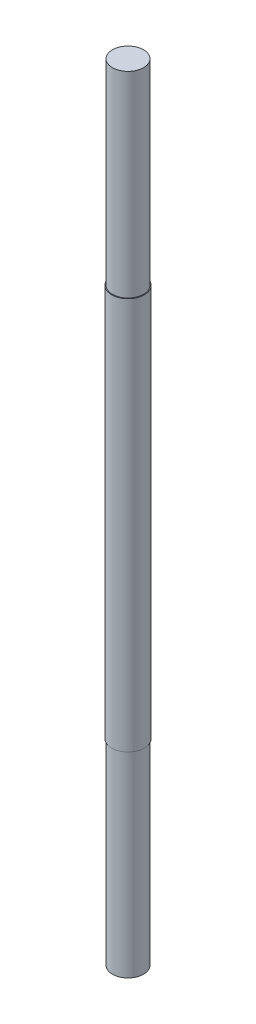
ISO-10303-21;
HEADER;
FILE_DESCRIPTION(('STEP AP214'),'2;1');
FILE_NAME('part.step','',(''),(''),'','','');
FILE_SCHEMA(('AUTOMOTIVE_DESIGN { 1 0 10303 214 1 1 1 1 }'));
ENDSEC;
DATA;
#1=APPLICATION_CONTEXT('core data for automotive mechanical design processes');
#2=APPLICATION_PROTOCOL_DEFINITION('international standard','automotive_design',2000,#1);
#3=PRODUCT_CONTEXT('',#1,'mechanical');
#4=PRODUCT('Part','Part','',(#3));
#5=PRODUCT_RELATED_PRODUCT_CATEGORY('part','',(#4));
#6=PRODUCT_DEFINITION_FORMATION('','',#4);
#7=PRODUCT_DEFINITION_CONTEXT('part definition',#1,'design');
#8=PRODUCT_DEFINITION('design','',#6,#7);
#9=PRODUCT_DEFINITION_SHAPE('','',#8);
#10=(LENGTH_UNIT() NAMED_UNIT(*) SI_UNIT(.MILLI.,.METRE.));
#11=(NAMED_UNIT(*) PLANE_ANGLE_UNIT() SI_UNIT($,.RADIAN.));
#12=(NAMED_UNIT(*) SI_UNIT($,.STERADIAN.) SOLID_ANGLE_UNIT());
#13=UNCERTAINTY_MEASURE_WITH_UNIT(LENGTH_MEASURE(1.E-05),#10,'distance_accuracy_value','');
#14=(GEOMETRIC_REPRESENTATION_CONTEXT(3) GLOBAL_UNCERTAINTY_ASSIGNED_CONTEXT((#13)) GLOBAL_UNIT_ASSIGNED_CONTEXT((#10,
#11,#12)) REPRESENTATION_CONTEXT('',''));
#15=CARTESIAN_POINT('',(0.,0.,0.));
#16=DIRECTION('',(0.,0.,1.));
#17=DIRECTION('',(1.,0.,0.));
#18=AXIS2_PLACEMENT_3D('',#15,#16,#17);
#19=CARTESIAN_POINT('',(0.,152.4,0.));
#20=DIRECTION('',(0.,-1.,0.));
#21=DIRECTION('',(0.,0.,-1.));
#22=AXIS2_PLACEMENT_3D('',#19,#20,#21);
#23=CYLINDRICAL_SURFACE('',#22,6.35);
#24=CARTESIAN_POINT('',(0.,76.2,0.));
#25=DIRECTION('',(0.,1.,0.));
#26=DIRECTION('',(0.,0.,1.));
#27=AXIS2_PLACEMENT_3D('',#24,#25,#26);
#28=CIRCLE('',#27,6.35);
#29=CARTESIAN_POINT('',(0.,76.2,-6.35));
#30=VERTEX_POINT('',#29);
#31=EDGE_CURVE('E10',#30,#30,#28,.T.);
#32=CARTESIAN_POINT('',(0.,-76.2,0.));
#33=DIRECTION('',(0.,-1.,0.));
#34=DIRECTION('',(0.,0.,-1.));
#35=AXIS2_PLACEMENT_3D('',#32,#33,#34);
#36=CIRCLE('',#35,6.35);
#37=CARTESIAN_POINT('',(0.,-76.2,-6.35));
#38=VERTEX_POINT('',#37);
#39=EDGE_CURVE('E36',#38,#38,#36,.T.);
#40=CARTESIAN_POINT('',(0.,76.2,-6.35));
#41=CARTESIAN_POINT('',(0.,74.6125,-6.35));
#42=CARTESIAN_POINT('',(0.,73.025,-6.35));
#43=CARTESIAN_POINT('',(0.,69.85,-6.35));
#44=CARTESIAN_POINT('',(0.,68.2625,-6.35));
#45=CARTESIAN_POINT('',(0.,65.0875,-6.35));
#46=CARTESIAN_POINT('',(0.,63.5,-6.35));
#47=CARTESIAN_POINT('',(0.,60.325,-6.35));
#48=CARTESIAN_POINT('',(0.,58.7375,-6.35));
#49=CARTESIAN_POINT('',(0.,55.5625,-6.35));
#50=CARTESIAN_POINT('',(0.,53.975,-6.35));
#51=CARTESIAN_POINT('',(0.,50.8,-6.35));
#52=CARTESIAN_POINT('',(0.,49.2125,-6.35));
#53=CARTESIAN_POINT('',(0.,46.0375,-6.35));
#54=CARTESIAN_POINT('',(0.,44.45,-6.35));
#55=CARTESIAN_POINT('',(0.,41.275,-6.35));
#56=CARTESIAN_POINT('',(0.,39.6875,-6.35));
#57=CARTESIAN_POINT('',(0.,36.5125,-6.35));
#58=CARTESIAN_POINT('',(0.,34.925,-6.35));
#59=CARTESIAN_POINT('',(0.,31.75,-6.35));
#60=CARTESIAN_POINT('',(0.,30.1625,-6.35));
#61=CARTESIAN_POINT('',(0.,26.9875,-6.35));
#62=CARTESIAN_POINT('',(0.,25.4,-6.35));
#63=CARTESIAN_POINT('',(0.,22.225,-6.35));
#64=CARTESIAN_POINT('',(0.,20.6375,-6.35));
#65=CARTESIAN_POINT('',(0.,17.4625,-6.35));
#66=CARTESIAN_POINT('',(0.,15.875,-6.35));
#67=CARTESIAN_POINT('',(0.,12.7,-6.35));
#68=CARTESIAN_POINT('',(0.,11.1125,-6.35));
#69=CARTESIAN_POINT('',(0.,7.93750000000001,-6.35));
#70=CARTESIAN_POINT('',(0.,6.35,-6.35));
#71=CARTESIAN_POINT('',(0.,3.175,-6.35));
#72=CARTESIAN_POINT('',(0.,1.5875,-6.35));
#73=CARTESIAN_POINT('',(0.,-1.5875,-6.35));
#74=CARTESIAN_POINT('',(0.,-3.175,-6.35));
#75=CARTESIAN_POINT('',(0.,-6.35,-6.35));
#76=CARTESIAN_POINT('',(0.,-7.93750000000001,-6.35));
#77=CARTESIAN_POINT('',(0.,-11.1125,-6.35));
#78=CARTESIAN_POINT('',(0.,-12.7,-6.35));
#79=CARTESIAN_POINT('',(0.,-15.875,-6.35));
#80=CARTESIAN_POINT('',(0.,-17.4625,-6.35));
#81=CARTESIAN_POINT('',(0.,-20.6375,-6.35));
#82=CARTESIAN_POINT('',(0.,-22.225,-6.35));
#83=CARTESIAN_POINT('',(0.,-25.4,-6.35));
#84=CARTESIAN_POINT('',(0.,-26.9875,-6.35));
#85=CARTESIAN_POINT('',(0.,-30.1625,-6.35));
#86=CARTESIAN_POINT('',(0.,-31.75,-6.35));
#87=CARTESIAN_POINT('',(0.,-34.925,-6.35));
#88=CARTESIAN_POINT('',(0.,-36.5125,-6.35));
#89=CARTESIAN_POINT('',(0.,-39.6875,-6.35));
#90=CARTESIAN_POINT('',(0.,-41.275,-6.35));
#91=CARTESIAN_POINT('',(0.,-44.45,-6.35));
#92=CARTESIAN_POINT('',(0.,-46.0375,-6.35));
#93=CARTESIAN_POINT('',(0.,-49.2125,-6.35));
#94=CARTESIAN_POINT('',(0.,-50.8,-6.35));
#95=CARTESIAN_POINT('',(0.,-53.975,-6.35));
#96=CARTESIAN_POINT('',(0.,-55.5625,-6.35));
#97=CARTESIAN_POINT('',(0.,-58.7375,-6.35));
#98=CARTESIAN_POINT('',(0.,-60.325,-6.35));
#99=CARTESIAN_POINT('',(0.,-63.5,-6.35));
#100=CARTESIAN_POINT('',(0.,-65.0875,-6.35));
#101=CARTESIAN_POINT('',(0.,-68.2625,-6.35));
#102=CARTESIAN_POINT('',(0.,-69.85,-6.35));
#103=CARTESIAN_POINT('',(0.,-73.025,-6.35));
#104=CARTESIAN_POINT('',(0.,-74.6125,-6.35));
#105=CARTESIAN_POINT('',(0.,-76.2,-6.35));
#106=B_SPLINE_CURVE_WITH_KNOTS('',3,(#40,#41,#42,#43,#44,#45,#46,#47,#48,#49,#50,#51,#52,#53,
#54,#55,#56,#57,#58,#59,#60,#61,#62,#63,#64,#65,#66,#67,#68,#69,#70,#71,#72,#73,#74,#75,#76,#77,
#78,#79,#80,#81,#82,#83,#84,#85,#86,#87,#88,#89,#90,#91,#92,#93,#94,#95,#96,#97,#98,#99,#100,
#101,#102,#103,#104,#105),.UNSPECIFIED.,.F.,.F.,(4,2,2,2,2,2,2,2,2,2,2,2,2,2,2,2,2,2,2,2,2,2,2,
2,2,2,2,2,2,2,2,2,4),(0.,4.7625,9.52500000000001,14.2875,19.05,23.8125,28.575,33.3375,38.1,
42.8625,47.625,52.3875,57.15,61.9125,66.675,71.4375,76.2,80.9625,85.725,90.4875,95.25,100.0125,
104.775,109.5375,114.3,119.0625,123.825,128.5875,133.35,138.1125,142.875,147.6375,152.4),.UNSPECIFIED.);
#107=EDGE_CURVE('BSEAM33',#30,#38,#106,.T.);
#108=ORIENTED_EDGE('',*,*,#31,.F.);
#109=ORIENTED_EDGE('',*,*,#39,.F.);
#110=ORIENTED_EDGE('',*,*,#107,.T.);
#111=ORIENTED_EDGE('',*,*,#107,.F.);
#112=EDGE_LOOP('',(#108,#110,#109,#111));
#113=FACE_BOUND('',#112,.T.);
#114=ADVANCED_FACE('F33',(#113),#23,.T.);
#115=CARTESIAN_POINT('',(0.,76.2,0.));
#116=DIRECTION('',(0.,1.,0.));
#117=DIRECTION('',(0.,0.,1.));
#118=AXIS2_PLACEMENT_3D('',#115,#116,#117);
#119=PLANE('',#118);
#120=CARTESIAN_POINT('',(0.,76.2,0.));
#121=DIRECTION('',(0.,1.,0.));
#122=DIRECTION('',(0.,0.,1.));
#123=AXIS2_PLACEMENT_3D('',#120,#121,#122);
#124=CIRCLE('',#123,6.0325);
#125=CARTESIAN_POINT('',(0.,76.2,6.0325));
#126=VERTEX_POINT('',#125);
#127=EDGE_CURVE('E40',#126,#126,#124,.T.);
#128=ORIENTED_EDGE('',*,*,#127,.F.);
#129=EDGE_LOOP('',(#128));
#130=FACE_BOUND('',#129,.T.);
#131=ORIENTED_EDGE('',*,*,#31,.T.);
#132=EDGE_LOOP('',(#131));
#133=FACE_BOUND('',#132,.T.);
#134=ADVANCED_FACE('F62',(#130,#133),#119,.T.);
#135=CARTESIAN_POINT('',(0.,76.2,0.));
#136=DIRECTION('',(0.,1.,0.));
#137=DIRECTION('',(0.,0.,1.));
#138=AXIS2_PLACEMENT_3D('',#135,#136,#137);
#139=CYLINDRICAL_SURFACE('',#138,6.0325);
#140=CARTESIAN_POINT('',(0.,152.4,0.));
#141=DIRECTION('',(0.,1.,0.));
#142=DIRECTION('',(0.,0.,1.));
#143=AXIS2_PLACEMENT_3D('',#140,#141,#142);
#144=CIRCLE('',#143,6.0325);
#145=CARTESIAN_POINT('',(0.,152.4,6.0325));
#146=VERTEX_POINT('',#145);
#147=EDGE_CURVE('E44',#146,#146,#144,.T.);
#148=CARTESIAN_POINT('',(0.,76.2,6.0325));
#149=CARTESIAN_POINT('',(0.,76.99375,6.0325));
#150=CARTESIAN_POINT('',(0.,77.7875,6.0325));
#151=CARTESIAN_POINT('',(0.,79.375,6.0325));
#152=CARTESIAN_POINT('',(0.,80.16875,6.0325));
#153=CARTESIAN_POINT('',(0.,81.75625,6.0325));
#154=CARTESIAN_POINT('',(0.,82.55,6.0325));
#155=CARTESIAN_POINT('',(0.,84.1375,6.0325));
#156=CARTESIAN_POINT('',(0.,84.93125,6.0325));
#157=CARTESIAN_POINT('',(0.,86.51875,6.0325));
#158=CARTESIAN_POINT('',(0.,87.3125,6.0325));
#159=CARTESIAN_POINT('',(0.,88.9,6.0325));
#160=CARTESIAN_POINT('',(0.,89.69375,6.0325));
#161=CARTESIAN_POINT('',(0.,91.28125,6.0325));
#162=CARTESIAN_POINT('',(0.,92.075,6.0325));
#163=CARTESIAN_POINT('',(0.,93.6625,6.0325));
#164=CARTESIAN_POINT('',(0.,94.45625,6.0325));
#165=CARTESIAN_POINT('',(0.,96.04375,6.0325));
#166=CARTESIAN_POINT('',(0.,96.8375,6.0325));
#167=CARTESIAN_POINT('',(0.,98.425,6.0325));
#168=CARTESIAN_POINT('',(0.,99.21875,6.0325));
#169=CARTESIAN_POINT('',(0.,100.80625,6.0325));
#170=CARTESIAN_POINT('',(0.,101.6,6.0325));
#171=CARTESIAN_POINT('',(0.,103.1875,6.0325));
#172=CARTESIAN_POINT('',(0.,103.98125,6.0325));
#173=CARTESIAN_POINT('',(0.,105.56875,6.0325));
#174=CARTESIAN_POINT('',(0.,106.3625,6.0325));
#175=CARTESIAN_POINT('',(0.,107.95,6.0325));
#176=CARTESIAN_POINT('',(0.,108.74375,6.0325));
#177=CARTESIAN_POINT('',(0.,110.33125,6.0325));
#178=CARTESIAN_POINT('',(0.,111.125,6.0325));
#179=CARTESIAN_POINT('',(0.,112.7125,6.0325));
#180=CARTESIAN_POINT('',(0.,113.50625,6.0325));
#181=CARTESIAN_POINT('',(0.,115.09375,6.0325));
#182=CARTESIAN_POINT('',(0.,115.8875,6.0325));
#183=CARTESIAN_POINT('',(0.,117.475,6.0325));
#184=CARTESIAN_POINT('',(0.,118.26875,6.0325));
#185=CARTESIAN_POINT('',(0.,119.85625,6.0325));
#186=CARTESIAN_POINT('',(0.,120.65,6.0325));
#187=CARTESIAN_POINT('',(0.,122.2375,6.0325));
#188=CARTESIAN_POINT('',(0.,123.03125,6.0325));
#189=CARTESIAN_POINT('',(0.,124.61875,6.0325));
#190=CARTESIAN_POINT('',(0.,125.4125,6.0325));
#191=CARTESIAN_POINT('',(0.,127.,6.0325));
#192=CARTESIAN_POINT('',(0.,127.79375,6.0325));
#193=CARTESIAN_POINT('',(0.,129.38125,6.0325));
#194=CARTESIAN_POINT('',(0.,130.175,6.0325));
#195=CARTESIAN_POINT('',(0.,131.7625,6.0325));
#196=CARTESIAN_POINT('',(0.,132.55625,6.0325));
#197=CARTESIAN_POINT('',(0.,134.14375,6.0325));
#198=CARTESIAN_POINT('',(0.,134.9375,6.0325));
#199=CARTESIAN_POINT('',(0.,136.525,6.0325));
#200=CARTESIAN_POINT('',(0.,137.31875,6.0325));
#201=CARTESIAN_POINT('',(0.,138.90625,6.0325));
#202=CARTESIAN_POINT('',(0.,139.7,6.0325));
#203=CARTESIAN_POINT('',(0.,141.2875,6.0325));
#204=CARTESIAN_POINT('',(0.,142.08125,6.0325));
#205=CARTESIAN_POINT('',(0.,143.66875,6.0325));
#206=CARTESIAN_POINT('',(0.,144.4625,6.0325));
#207=CARTESIAN_POINT('',(0.,146.05,6.0325));
#208=CARTESIAN_POINT('',(0.,146.84375,6.0325));
#209=CARTESIAN_POINT('',(0.,148.43125,6.0325));
#210=CARTESIAN_POINT('',(0.,149.225,6.0325));
#211=CARTESIAN_POINT('',(0.,150.8125,6.0325));
#212=CARTESIAN_POINT('',(0.,151.60625,6.0325));
#213=CARTESIAN_POINT('',(0.,152.4,6.0325));
#214=B_SPLINE_CURVE_WITH_KNOTS('',3,(#148,#149,#150,#151,#152,#153,#154,#155,#156,#157,#158,
#159,#160,#161,#162,#163,#164,#165,#166,#167,#168,#169,#170,#171,#172,#173,#174,#175,#176,#177,
#178,#179,#180,#181,#182,#183,#184,#185,#186,#187,#188,#189,#190,#191,#192,#193,#194,#195,#196,
#197,#198,#199,#200,#201,#202,#203,#204,#205,#206,#207,#208,#209,#210,#211,#212,#213),
.UNSPECIFIED.,.F.,.F.,(4,2,2,2,2,2,2,2,2,2,2,2,2,2,2,2,2,2,2,2,2,2,2,2,2,2,2,2,2,2,2,2,4),(0.,
2.38125,4.7625,7.14375,9.52500000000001,11.90625,14.2875,16.66875,19.05,21.43125,23.8125,
26.19375,28.575,30.95625,33.3375,35.71875,38.1,40.48125,42.8625,45.24375,47.625,50.00625,
52.3875,54.76875,57.15,59.53125,61.9125,64.29375,66.675,69.05625,71.4375,73.81875,76.2),.UNSPECIFIED.);
#215=EDGE_CURVE('BSEAM67',#126,#146,#214,.T.);
#216=ORIENTED_EDGE('',*,*,#127,.T.);
#217=ORIENTED_EDGE('',*,*,#147,.F.);
#218=ORIENTED_EDGE('',*,*,#215,.T.);
#219=ORIENTED_EDGE('',*,*,#215,.F.);
#220=EDGE_LOOP('',(#216,#218,#217,#219));
#221=FACE_BOUND('',#220,.T.);
#222=ADVANCED_FACE('F67',(#221),#139,.T.);
#223=CARTESIAN_POINT('',(0.,152.4,0.));
#224=DIRECTION('',(0.,1.,0.));
#225=DIRECTION('',(0.,0.,1.));
#226=AXIS2_PLACEMENT_3D('',#223,#224,#225);
#227=PLANE('',#226);
#228=ORIENTED_EDGE('',*,*,#147,.T.);
#229=EDGE_LOOP('',(#228));
#230=FACE_BOUND('',#229,.T.);
#231=ADVANCED_FACE('F73',(#230),#227,.T.);
#232=CARTESIAN_POINT('',(0.,-76.2,0.));
#233=DIRECTION('',(0.,-1.,0.));
#234=DIRECTION('',(0.,0.,-1.));
#235=AXIS2_PLACEMENT_3D('',#232,#233,#234);
#236=PLANE('',#235);
#237=CARTESIAN_POINT('',(0.,-76.2,0.));
#238=DIRECTION('',(0.,-1.,0.));
#239=DIRECTION('',(0.,0.,-1.));
#240=AXIS2_PLACEMENT_3D('',#237,#238,#239);
#241=CIRCLE('',#240,6.0325);
#242=CARTESIAN_POINT('',(0.,-76.2,-6.0325));
#243=VERTEX_POINT('',#242);
#244=EDGE_CURVE('E52',#243,#243,#241,.T.);
#245=ORIENTED_EDGE('',*,*,#244,.F.);
#246=EDGE_LOOP('',(#245));
#247=FACE_BOUND('',#246,.T.);
#248=ORIENTED_EDGE('',*,*,#39,.T.);
#249=EDGE_LOOP('',(#248));
#250=FACE_BOUND('',#249,.T.);
#251=ADVANCED_FACE('F59',(#247,#250),#236,.T.);
#252=CARTESIAN_POINT('',(0.,-76.2,0.));
#253=DIRECTION('',(0.,-1.,0.));
#254=DIRECTION('',(0.,0.,-1.));
#255=AXIS2_PLACEMENT_3D('',#252,#253,#254);
#256=CYLINDRICAL_SURFACE('',#255,6.0325);
#257=CARTESIAN_POINT('',(0.,-152.4,0.));
#258=DIRECTION('',(0.,-1.,0.));
#259=DIRECTION('',(0.,0.,-1.));
#260=AXIS2_PLACEMENT_3D('',#257,#258,#259);
#261=CIRCLE('',#260,6.0325);
#262=CARTESIAN_POINT('',(0.,-152.4,-6.0325));
#263=VERTEX_POINT('',#262);
#264=EDGE_CURVE('E49',#263,#263,#261,.T.);
#265=CARTESIAN_POINT('',(0.,-76.2,-6.0325));
#266=CARTESIAN_POINT('',(0.,-76.99375,-6.0325));
#267=CARTESIAN_POINT('',(0.,-77.7875,-6.0325));
#268=CARTESIAN_POINT('',(0.,-79.375,-6.0325));
#269=CARTESIAN_POINT('',(0.,-80.16875,-6.0325));
#270=CARTESIAN_POINT('',(0.,-81.75625,-6.0325));
#271=CARTESIAN_POINT('',(0.,-82.55,-6.0325));
#272=CARTESIAN_POINT('',(0.,-84.1375,-6.0325));
#273=CARTESIAN_POINT('',(0.,-84.93125,-6.0325));
#274=CARTESIAN_POINT('',(0.,-86.51875,-6.0325));
#275=CARTESIAN_POINT('',(0.,-87.3125,-6.0325));
#276=CARTESIAN_POINT('',(0.,-88.9,-6.0325));
#277=CARTESIAN_POINT('',(0.,-89.69375,-6.0325));
#278=CARTESIAN_POINT('',(0.,-91.28125,-6.0325));
#279=CARTESIAN_POINT('',(0.,-92.075,-6.0325));
#280=CARTESIAN_POINT('',(0.,-93.6625,-6.0325));
#281=CARTESIAN_POINT('',(0.,-94.45625,-6.0325));
#282=CARTESIAN_POINT('',(0.,-96.04375,-6.0325));
#283=CARTESIAN_POINT('',(0.,-96.8375,-6.0325));
#284=CARTESIAN_POINT('',(0.,-98.425,-6.0325));
#285=CARTESIAN_POINT('',(0.,-99.21875,-6.0325));
#286=CARTESIAN_POINT('',(0.,-100.80625,-6.0325));
#287=CARTESIAN_POINT('',(0.,-101.6,-6.0325));
#288=CARTESIAN_POINT('',(0.,-103.1875,-6.0325));
#289=CARTESIAN_POINT('',(0.,-103.98125,-6.0325));
#290=CARTESIAN_POINT('',(0.,-105.56875,-6.0325));
#291=CARTESIAN_POINT('',(0.,-106.3625,-6.0325));
#292=CARTESIAN_POINT('',(0.,-107.95,-6.0325));
#293=CARTESIAN_POINT('',(0.,-108.74375,-6.0325));
#294=CARTESIAN_POINT('',(0.,-110.33125,-6.0325));
#295=CARTESIAN_POINT('',(0.,-111.125,-6.0325));
#296=CARTESIAN_POINT('',(0.,-112.7125,-6.0325));
#297=CARTESIAN_POINT('',(0.,-113.50625,-6.0325));
#298=CARTESIAN_POINT('',(0.,-115.09375,-6.0325));
#299=CARTESIAN_POINT('',(0.,-115.8875,-6.0325));
#300=CARTESIAN_POINT('',(0.,-117.475,-6.0325));
#301=CARTESIAN_POINT('',(0.,-118.26875,-6.0325));
#302=CARTESIAN_POINT('',(0.,-119.85625,-6.0325));
#303=CARTESIAN_POINT('',(0.,-120.65,-6.0325));
#304=CARTESIAN_POINT('',(0.,-122.2375,-6.0325));
#305=CARTESIAN_POINT('',(0.,-123.03125,-6.0325));
#306=CARTESIAN_POINT('',(0.,-124.61875,-6.0325));
#307=CARTESIAN_POINT('',(0.,-125.4125,-6.0325));
#308=CARTESIAN_POINT('',(0.,-127.,-6.0325));
#309=CARTESIAN_POINT('',(0.,-127.79375,-6.0325));
#310=CARTESIAN_POINT('',(0.,-129.38125,-6.0325));
#311=CARTESIAN_POINT('',(0.,-130.175,-6.0325));
#312=CARTESIAN_POINT('',(0.,-131.7625,-6.0325));
#313=CARTESIAN_POINT('',(0.,-132.55625,-6.0325));
#314=CARTESIAN_POINT('',(0.,-134.14375,-6.0325));
#315=CARTESIAN_POINT('',(0.,-134.9375,-6.0325));
#316=CARTESIAN_POINT('',(0.,-136.525,-6.0325));
#317=CARTESIAN_POINT('',(0.,-137.31875,-6.0325));
#318=CARTESIAN_POINT('',(0.,-138.90625,-6.0325));
#319=CARTESIAN_POINT('',(0.,-139.7,-6.0325));
#320=CARTESIAN_POINT('',(0.,-141.2875,-6.0325));
#321=CARTESIAN_POINT('',(0.,-142.08125,-6.0325));
#322=CARTESIAN_POINT('',(0.,-143.66875,-6.0325));
#323=CARTESIAN_POINT('',(0.,-144.4625,-6.0325));
#324=CARTESIAN_POINT('',(0.,-146.05,-6.0325));
#325=CARTESIAN_POINT('',(0.,-146.84375,-6.0325));
#326=CARTESIAN_POINT('',(0.,-148.43125,-6.0325));
#327=CARTESIAN_POINT('',(0.,-149.225,-6.0325));
#328=CARTESIAN_POINT('',(0.,-150.8125,-6.0325));
#329=CARTESIAN_POINT('',(0.,-151.60625,-6.0325));
#330=CARTESIAN_POINT('',(0.,-152.4,-6.0325));
#331=B_SPLINE_CURVE_WITH_KNOTS('',3,(#265,#266,#267,#268,#269,#270,#271,#272,#273,#274,#275,
#276,#277,#278,#279,#280,#281,#282,#283,#284,#285,#286,#287,#288,#289,#290,#291,#292,#293,#294,
#295,#296,#297,#298,#299,#300,#301,#302,#303,#304,#305,#306,#307,#308,#309,#310,#311,#312,#313,
#314,#315,#316,#317,#318,#319,#320,#321,#322,#323,#324,#325,#326,#327,#328,#329,#330),
.UNSPECIFIED.,.F.,.F.,(4,2,2,2,2,2,2,2,2,2,2,2,2,2,2,2,2,2,2,2,2,2,2,2,2,2,2,2,2,2,2,2,4),(0.,
2.38125,4.7625,7.14375,9.52500000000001,11.90625,14.2875,16.66875,19.05,21.43125,23.8125,
26.19375,28.575,30.95625,33.3375,35.71875,38.1,40.48125,42.8625,45.24375,47.625,50.00625,
52.3875,54.76875,57.15,59.53125,61.9125,64.29375,66.675,69.05625,71.4375,73.81875,76.2),.UNSPECIFIED.);
#332=EDGE_CURVE('BSEAM83',#243,#263,#331,.T.);
#333=ORIENTED_EDGE('',*,*,#244,.T.);
#334=ORIENTED_EDGE('',*,*,#264,.F.);
#335=ORIENTED_EDGE('',*,*,#332,.T.);
#336=ORIENTED_EDGE('',*,*,#332,.F.);
#337=EDGE_LOOP('',(#333,#335,#334,#336));
#338=FACE_BOUND('',#337,.T.);
#339=ADVANCED_FACE('F83',(#338),#256,.T.);
#340=CARTESIAN_POINT('',(0.,-152.4,0.));
#341=DIRECTION('',(0.,1.,0.));
#342=DIRECTION('',(0.,0.,1.));
#343=AXIS2_PLACEMENT_3D('',#340,#341,#342);
#344=PLANE('',#343);
#345=ORIENTED_EDGE('',*,*,#264,.T.);
#346=EDGE_LOOP('',(#345));
#347=FACE_BOUND('',#346,.T.);
#348=ADVANCED_FACE('F81',(#347),#344,.F.);
#349=CLOSED_SHELL('',(#114,#134,#222,#231,#251,#339,#348));
#350=MANIFOLD_SOLID_BREP('B2',#349);
#351=ADVANCED_BREP_SHAPE_REPRESENTATION('',(#18,#350),#14);
#352=SHAPE_DEFINITION_REPRESENTATION(#9,#351);
ENDSEC;
END-ISO-10303-21;
